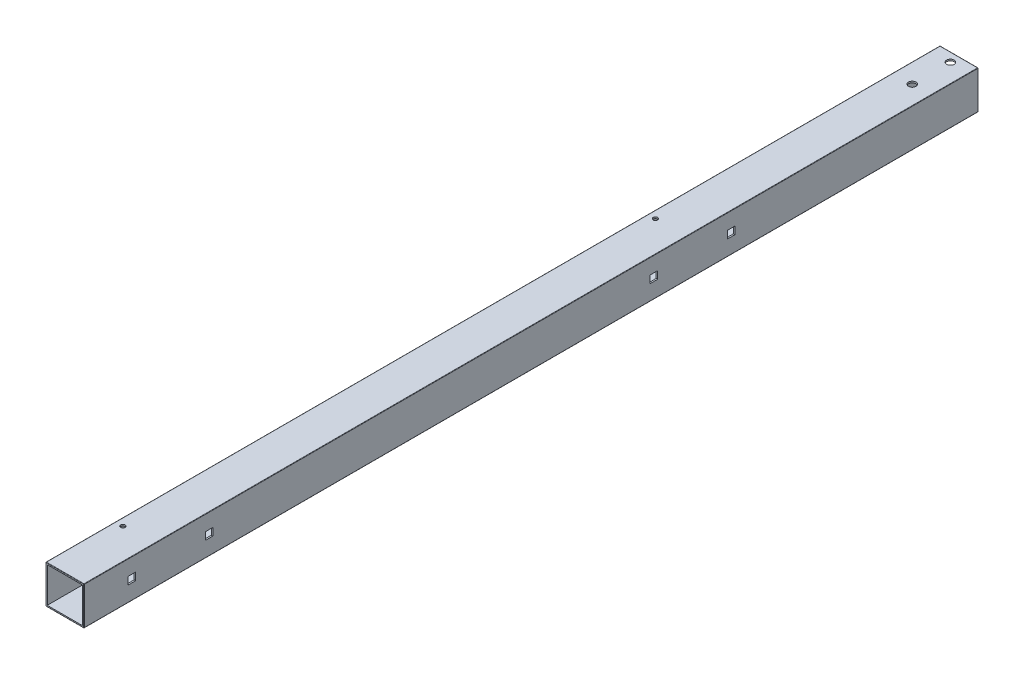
from build123d import *

# Parameters (mm, degrees)
ESQUISSE1_W      = 51
ESQUISSE1_H      = 51
ESQUISSE1_W_2    = 47
ESQUISSE1_H_2    = 47
EXTRUSION1_DEPTH = 1194
ESQUISSE2_W      = 10
ESQUISSE2_H      = 10
EXTRUSION2_DEPTH = 1197.176408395
EXTRUSION3_REACH = 1198.176
ESQUISSE3_R      = 3
ESQUISSE3_R_2    = 5
CONG_1_R         = 0.5


with BuildPart() as part:
    # Esquisse1 → Extrusion1 (new body)
    with BuildSketch(Plane.XY):
        with Locations((25.5, 25.5)):
            Rectangle(ESQUISSE1_W, ESQUISSE1_H)
        with Locations((25.5, 25.5)):
            Rectangle(ESQUISSE1_W_2, ESQUISSE1_H_2, mode=Mode.SUBTRACT)
    extrude(amount=EXTRUSION1_DEPTH)

    # Esquisse2 → Extrusion2 (cut, through all)
    with BuildSketch(Plane(origin=(51, 0, 0), x_dir=(0, 0, -1), z_dir=(1, 0, 0))):
        with Locations((-330, 25.5)):
            Rectangle(ESQUISSE2_W, ESQUISSE2_H)
        with Locations((-1027, 25.5)):
            Rectangle(ESQUISSE2_W, ESQUISSE2_H)
        with Locations((-433, 25.5)):
            Rectangle(ESQUISSE2_W, ESQUISSE2_H)
        with Locations((-1130, 25.5)):
            Rectangle(ESQUISSE2_W, ESQUISSE2_H)
    extrude(amount=-EXTRUSION2_DEPTH, mode=Mode.SUBTRACT)

    # Esquisse3 → Extrusion3 (cut, up to next)
    with BuildSketch(Plane(origin=(0, 51, 0), x_dir=(1, 0, 0), z_dir=(0, 1, 0)), mode=Mode.PRIVATE) as extrusion3_sk1:
        with Locations(Location((10, -1101, 0), (0, 0, 270))):
            Circle(ESQUISSE3_R)
    extrusion3_tool1 = extrude(extrusion3_sk1.sketch, amount=-EXTRUSION3_REACH, mode=Mode.PRIVATE) & part.part
    # Esquisse3 → Extrusion3 (cut, up to next)
    with BuildSketch(Plane(origin=(0, 51, 0), x_dir=(1, 0, 0), z_dir=(0, 1, 0)), mode=Mode.PRIVATE) as extrusion3_sk2:
        with Locations(Location((10, -390, 0), (0, 0, 270))):
            Circle(ESQUISSE3_R)
    extrusion3_tool2 = extrude(extrusion3_sk2.sketch, amount=-EXTRUSION3_REACH, mode=Mode.PRIVATE) & part.part
    # Esquisse3 → Extrusion3 (cut, up to next)
    with BuildSketch(Plane(origin=(0, 51, 0), x_dir=(1, 0, 0), z_dir=(0, 1, 0)), mode=Mode.PRIVATE) as extrusion3_sk3:
        with Locations(Location((25.9, -12, 0), (0, 0, 270))):
            Circle(ESQUISSE3_R_2)
    extrusion3_tool3 = extrude(extrusion3_sk3.sketch, amount=-EXTRUSION3_REACH, mode=Mode.PRIVATE) & part.part
    # Esquisse3 → Extrusion3 (cut, up to next)
    with BuildSketch(Plane(origin=(0, 51, 0), x_dir=(1, 0, 0), z_dir=(0, 1, 0)), mode=Mode.PRIVATE) as extrusion3_sk4:
        with Locations(Location((25.9, -63, 0), (0, 0, 270))):
            Circle(ESQUISSE3_R_2)
    extrusion3_tool4 = extrude(extrusion3_sk4.sketch, amount=-EXTRUSION3_REACH, mode=Mode.PRIVATE) & part.part
    add(extrusion3_tool1.solids().sort_by_distance((10, 51, 1101))[0], mode=Mode.SUBTRACT)
    add(extrusion3_tool2.solids().sort_by_distance((10, 51, 390))[0], mode=Mode.SUBTRACT)
    add(extrusion3_tool3.solids().sort_by_distance((25.9, 51, 12))[0], mode=Mode.SUBTRACT)
    add(extrusion3_tool4.solids().sort_by_distance((25.9, 51, 63))[0], mode=Mode.SUBTRACT)

    # Cong_1
    cong_1_edges = [part.edges().sort_by_distance(p)[0] for p in [
        (51, 25.5, 1194),
        (25.5, 51, 1194),
        (0, 25.5, 1194),
        (25.5, 51, 0),
        (51, 25.5, 0),
        (25.5, 0, 0),
        (0, 25.5, 0),
        (25.5, 0, 1194),
        (0, 51, 597),
        (51, 51, 597),
        (51, 0, 597),
        (0, 0, 597),
    ]]
    fillet(cong_1_edges, radius=CONG_1_R)


solid = part.part
